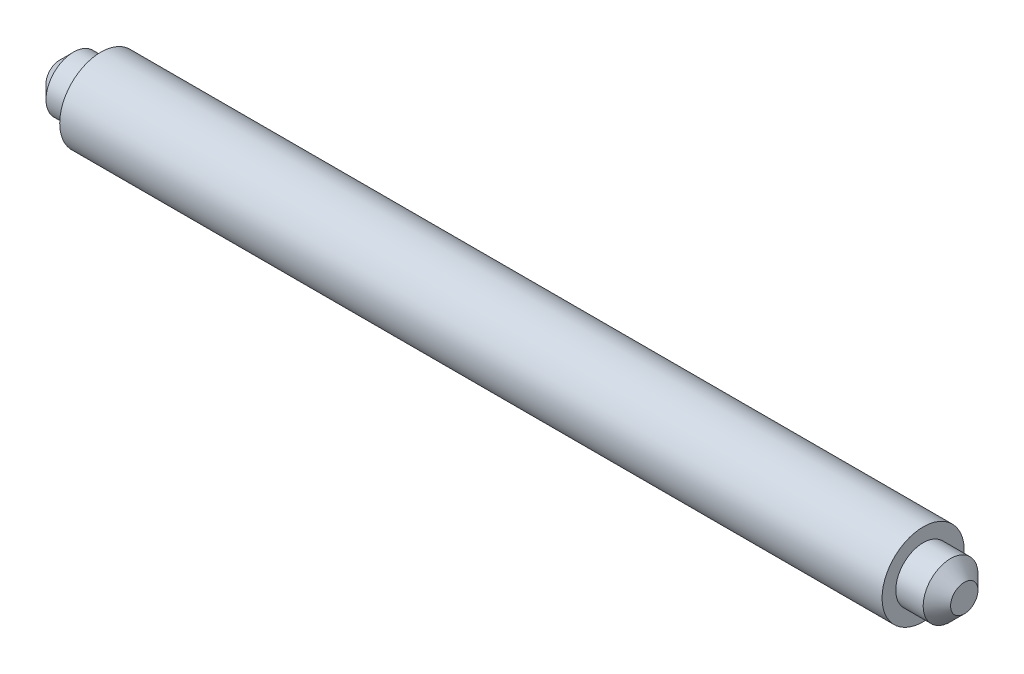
ISO-10303-21;
HEADER;
FILE_DESCRIPTION(('STEP AP214'),'2;1');
FILE_NAME('part.step','',(''),(''),'','','');
FILE_SCHEMA(('AUTOMOTIVE_DESIGN { 1 0 10303 214 1 1 1 1 }'));
ENDSEC;
DATA;
#1=APPLICATION_CONTEXT('core data for automotive mechanical design processes');
#2=APPLICATION_PROTOCOL_DEFINITION('international standard','automotive_design',2000,#1);
#3=PRODUCT_CONTEXT('',#1,'mechanical');
#4=PRODUCT('Part','Part','',(#3));
#5=PRODUCT_RELATED_PRODUCT_CATEGORY('part','',(#4));
#6=PRODUCT_DEFINITION_FORMATION('','',#4);
#7=PRODUCT_DEFINITION_CONTEXT('part definition',#1,'design');
#8=PRODUCT_DEFINITION('design','',#6,#7);
#9=PRODUCT_DEFINITION_SHAPE('','',#8);
#10=(LENGTH_UNIT() NAMED_UNIT(*) SI_UNIT(.MILLI.,.METRE.));
#11=(NAMED_UNIT(*) PLANE_ANGLE_UNIT() SI_UNIT($,.RADIAN.));
#12=(NAMED_UNIT(*) SI_UNIT($,.STERADIAN.) SOLID_ANGLE_UNIT());
#13=UNCERTAINTY_MEASURE_WITH_UNIT(LENGTH_MEASURE(1.E-05),#10,'distance_accuracy_value','');
#14=(GEOMETRIC_REPRESENTATION_CONTEXT(3) GLOBAL_UNCERTAINTY_ASSIGNED_CONTEXT((#13)) GLOBAL_UNIT_ASSIGNED_CONTEXT((#10,
#11,#12)) REPRESENTATION_CONTEXT('',''));
#15=CARTESIAN_POINT('',(0.,0.,0.));
#16=DIRECTION('',(0.,0.,1.));
#17=DIRECTION('',(1.,0.,0.));
#18=AXIS2_PLACEMENT_3D('',#15,#16,#17);
#19=CARTESIAN_POINT('',(-33.,2.00000000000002,0.));
#20=DIRECTION('',(1.,0.,0.));
#21=DIRECTION('',(0.,0.,-1.));
#22=AXIS2_PLACEMENT_3D('',#19,#20,#21);
#23=PLANE('',#22);
#24=CARTESIAN_POINT('',(-33.,0.,0.));
#25=DIRECTION('',(1.,0.,0.));
#26=DIRECTION('',(0.,0.,-1.));
#27=AXIS2_PLACEMENT_3D('',#24,#25,#26);
#28=CIRCLE('',#27,0.999999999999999);
#29=CARTESIAN_POINT('',(-33.,0.,-0.999999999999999));
#30=VERTEX_POINT('',#29);
#31=EDGE_CURVE('E33',#30,#30,#28,.F.);
#32=ORIENTED_EDGE('',*,*,#31,.T.);
#33=EDGE_LOOP('',(#32));
#34=FACE_BOUND('',#33,.T.);
#35=ADVANCED_FACE('F27',(#34),#23,.F.);
#36=CARTESIAN_POINT('',(-76.9999999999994,0.,0.));
#37=DIRECTION('',(-1.,0.,0.));
#38=DIRECTION('',(0.,0.,1.));
#39=AXIS2_PLACEMENT_3D('',#36,#37,#38);
#40=CYLINDRICAL_SURFACE('',#39,2.00000000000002);
#41=CARTESIAN_POINT('',(-32.,0.,0.));
#42=DIRECTION('',(1.,0.,0.));
#43=DIRECTION('',(0.,0.,-1.));
#44=AXIS2_PLACEMENT_3D('',#41,#42,#43);
#45=CIRCLE('',#44,2.00000000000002);
#46=CARTESIAN_POINT('',(-32.,0.,-2.00000000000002));
#47=VERTEX_POINT('',#46);
#48=EDGE_CURVE('E10',#47,#47,#45,.T.);
#49=ORIENTED_EDGE('',*,*,#48,.T.);
#50=EDGE_LOOP('',(#49));
#51=FACE_BOUND('',#50,.T.);
#52=CARTESIAN_POINT('',(-30.,0.,0.));
#53=DIRECTION('',(-1.,0.,0.));
#54=DIRECTION('',(0.,0.,1.));
#55=AXIS2_PLACEMENT_3D('',#52,#53,#54);
#56=CIRCLE('',#55,2.00000000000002);
#57=CARTESIAN_POINT('',(-30.,0.,2.00000000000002));
#58=VERTEX_POINT('',#57);
#59=EDGE_CURVE('E46',#58,#58,#56,.T.);
#60=ORIENTED_EDGE('',*,*,#59,.T.);
#61=EDGE_LOOP('',(#60));
#62=FACE_BOUND('',#61,.T.);
#63=ADVANCED_FACE('F77',(#51,#62),#40,.T.);
#64=CARTESIAN_POINT('',(-30.,3.00000000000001,0.));
#65=DIRECTION('',(1.,0.,0.));
#66=DIRECTION('',(0.,0.,-1.));
#67=AXIS2_PLACEMENT_3D('',#64,#65,#66);
#68=PLANE('',#67);
#69=ORIENTED_EDGE('',*,*,#59,.F.);
#70=EDGE_LOOP('',(#69));
#71=FACE_BOUND('',#70,.T.);
#72=CARTESIAN_POINT('',(-30.,0.,0.));
#73=DIRECTION('',(-1.,0.,0.));
#74=DIRECTION('',(0.,0.,1.));
#75=AXIS2_PLACEMENT_3D('',#72,#73,#74);
#76=CIRCLE('',#75,3.00000000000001);
#77=CARTESIAN_POINT('',(-30.,0.,3.00000000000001));
#78=VERTEX_POINT('',#77);
#79=EDGE_CURVE('E49',#78,#78,#76,.T.);
#80=ORIENTED_EDGE('',*,*,#79,.T.);
#81=EDGE_LOOP('',(#80));
#82=FACE_BOUND('',#81,.T.);
#83=ADVANCED_FACE('F81',(#71,#82),#68,.F.);
#84=CARTESIAN_POINT('',(-76.9999999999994,0.,0.));
#85=DIRECTION('',(-1.,0.,0.));
#86=DIRECTION('',(0.,0.,1.));
#87=AXIS2_PLACEMENT_3D('',#84,#85,#86);
#88=CYLINDRICAL_SURFACE('',#87,3.00000000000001);
#89=ORIENTED_EDGE('',*,*,#79,.F.);
#90=EDGE_LOOP('',(#89));
#91=FACE_BOUND('',#90,.T.);
#92=CARTESIAN_POINT('',(30.,0.,0.));
#93=DIRECTION('',(-1.,0.,0.));
#94=DIRECTION('',(0.,0.,1.));
#95=AXIS2_PLACEMENT_3D('',#92,#93,#94);
#96=CIRCLE('',#95,3.);
#97=CARTESIAN_POINT('',(30.,0.,3.));
#98=VERTEX_POINT('',#97);
#99=EDGE_CURVE('E52',#98,#98,#96,.T.);
#100=ORIENTED_EDGE('',*,*,#99,.T.);
#101=EDGE_LOOP('',(#100));
#102=FACE_BOUND('',#101,.T.);
#103=ADVANCED_FACE('F74',(#91,#102),#88,.T.);
#104=CARTESIAN_POINT('',(30.,3.,0.));
#105=DIRECTION('',(1.,0.,0.));
#106=DIRECTION('',(0.,0.,-1.));
#107=AXIS2_PLACEMENT_3D('',#104,#105,#106);
#108=PLANE('',#107);
#109=CARTESIAN_POINT('',(30.,0.,0.));
#110=DIRECTION('',(-1.,0.,0.));
#111=DIRECTION('',(0.,0.,1.));
#112=AXIS2_PLACEMENT_3D('',#109,#110,#111);
#113=CIRCLE('',#112,2.00000000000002);
#114=CARTESIAN_POINT('',(30.,0.,2.00000000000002));
#115=VERTEX_POINT('',#114);
#116=EDGE_CURVE('E55',#115,#115,#113,.T.);
#117=ORIENTED_EDGE('',*,*,#116,.T.);
#118=EDGE_LOOP('',(#117));
#119=FACE_BOUND('',#118,.T.);
#120=ORIENTED_EDGE('',*,*,#99,.F.);
#121=EDGE_LOOP('',(#120));
#122=FACE_BOUND('',#121,.T.);
#123=ADVANCED_FACE('F59',(#119,#122),#108,.T.);
#124=CARTESIAN_POINT('',(-76.9999999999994,0.,0.));
#125=DIRECTION('',(-1.,0.,0.));
#126=DIRECTION('',(0.,0.,1.));
#127=AXIS2_PLACEMENT_3D('',#124,#125,#126);
#128=CYLINDRICAL_SURFACE('',#127,2.00000000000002);
#129=CARTESIAN_POINT('',(32.,0.,0.));
#130=DIRECTION('',(1.,0.,0.));
#131=DIRECTION('',(0.,0.,-1.));
#132=AXIS2_PLACEMENT_3D('',#129,#130,#131);
#133=CIRCLE('',#132,2.00000000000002);
#134=CARTESIAN_POINT('',(32.,0.,-2.00000000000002));
#135=VERTEX_POINT('',#134);
#136=EDGE_CURVE('E41',#135,#135,#133,.F.);
#137=ORIENTED_EDGE('',*,*,#136,.T.);
#138=EDGE_LOOP('',(#137));
#139=FACE_BOUND('',#138,.T.);
#140=ORIENTED_EDGE('',*,*,#116,.F.);
#141=EDGE_LOOP('',(#140));
#142=FACE_BOUND('',#141,.T.);
#143=ADVANCED_FACE('F62',(#139,#142),#128,.T.);
#144=CARTESIAN_POINT('',(33.,2.00000000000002,0.));
#145=DIRECTION('',(1.,0.,0.));
#146=DIRECTION('',(0.,0.,-1.));
#147=AXIS2_PLACEMENT_3D('',#144,#145,#146);
#148=PLANE('',#147);
#149=CARTESIAN_POINT('',(33.,0.,0.));
#150=DIRECTION('',(1.,0.,0.));
#151=DIRECTION('',(0.,0.,-1.));
#152=AXIS2_PLACEMENT_3D('',#149,#150,#151);
#153=CIRCLE('',#152,1.);
#154=CARTESIAN_POINT('',(33.,0.,-1.));
#155=VERTEX_POINT('',#154);
#156=EDGE_CURVE('E37',#155,#155,#153,.T.);
#157=ORIENTED_EDGE('',*,*,#156,.T.);
#158=EDGE_LOOP('',(#157));
#159=FACE_BOUND('',#158,.T.);
#160=ADVANCED_FACE('F64',(#159),#148,.T.);
#161=CARTESIAN_POINT('',(32.,0.,0.));
#162=DIRECTION('',(-1.,0.,0.));
#163=DIRECTION('',(0.,0.,1.));
#164=AXIS2_PLACEMENT_3D('',#161,#162,#163);
#165=CONICAL_SURFACE('',#164,2.00000000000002,0.785398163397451);
#166=ORIENTED_EDGE('',*,*,#156,.F.);
#167=EDGE_LOOP('',(#166));
#168=FACE_BOUND('',#167,.T.);
#169=ORIENTED_EDGE('',*,*,#136,.F.);
#170=EDGE_LOOP('',(#169));
#171=FACE_BOUND('',#170,.T.);
#172=ADVANCED_FACE('F71',(#168,#171),#165,.T.);
#173=CARTESIAN_POINT('',(-33.,0.,0.));
#174=DIRECTION('',(1.,0.,0.));
#175=DIRECTION('',(0.,0.,-1.));
#176=AXIS2_PLACEMENT_3D('',#173,#174,#175);
#177=CONICAL_SURFACE('',#176,0.999999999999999,0.785398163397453);
#178=ORIENTED_EDGE('',*,*,#48,.F.);
#179=EDGE_LOOP('',(#178));
#180=FACE_BOUND('',#179,.T.);
#181=ORIENTED_EDGE('',*,*,#31,.F.);
#182=EDGE_LOOP('',(#181));
#183=FACE_BOUND('',#182,.T.);
#184=ADVANCED_FACE('F122',(#180,#183),#177,.T.);
#185=CLOSED_SHELL('',(#35,#63,#83,#103,#123,#143,#160,#172,#184));
#186=MANIFOLD_SOLID_BREP('B2',#185);
#187=ADVANCED_BREP_SHAPE_REPRESENTATION('',(#18,#186),#14);
#188=SHAPE_DEFINITION_REPRESENTATION(#9,#187);
ENDSEC;
END-ISO-10303-21;
